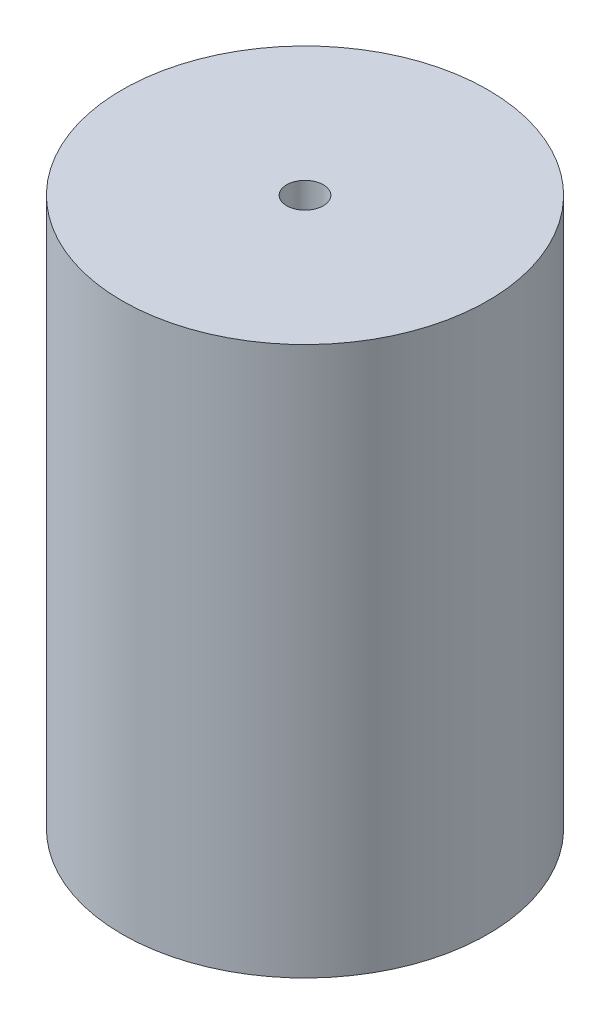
from build123d import *

# Parameters (mm, degrees)
SKETCH1_R           = 31.75
SKETCH1_R_2         = 3.175
BOSS_EXTRUDE1_DEPTH = 95.25


with BuildPart() as part:
    # Sketch1 → Boss-Extrude1 (new body)
    with BuildSketch(Plane(origin=(0, 0, 0), x_dir=(1, 0, 0), z_dir=(0, 1, 0))):
        with Locations(Location((0, 0, 0), (0, 0, 270))):
            Circle(SKETCH1_R)
        with Locations(Location((0, 0, 0), (0, 0, 270))):
            Circle(SKETCH1_R_2, mode=Mode.SUBTRACT)
    extrude(amount=BOSS_EXTRUDE1_DEPTH)


solid = part.part
